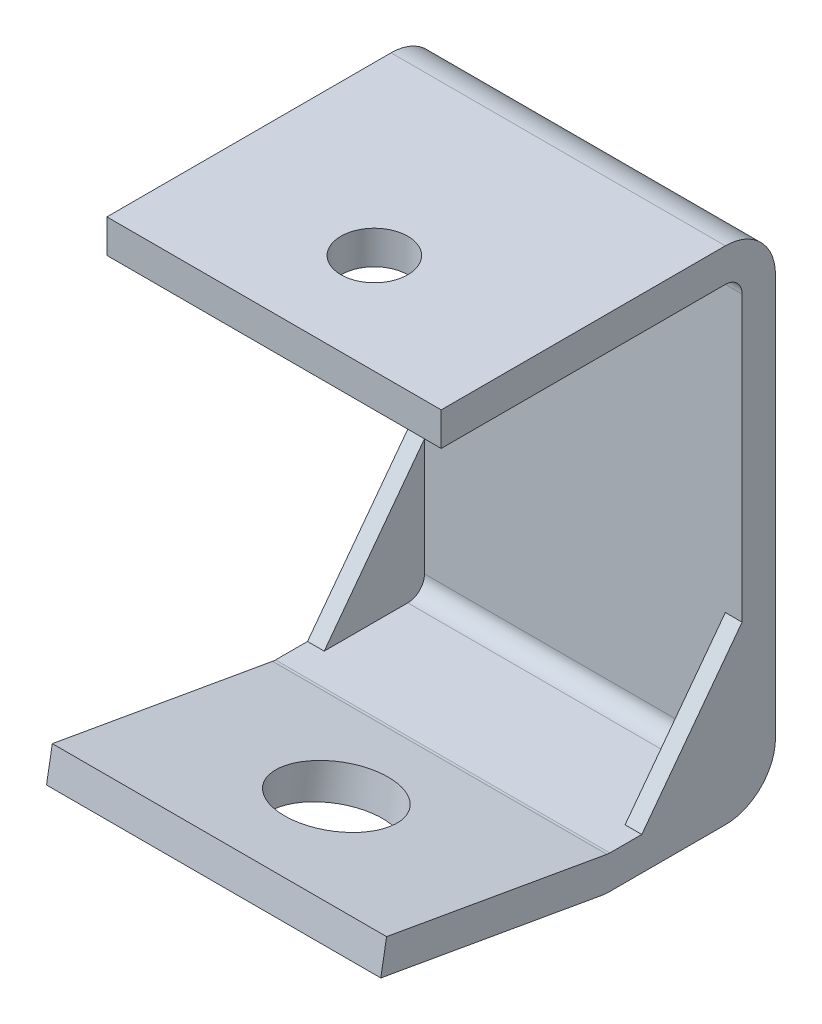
from build123d import *

# Parameters (mm, degrees)
BASE_EXTRUDE_THIN_DEPTH = 31.75
CUT_EXTRUDE1_REACH      = 123.615
SKETCH2_R               = 6.35
BOSS_EXTRUDE1_DEPTH     = 3.175
SKETCH4_R               = 10
CUT_EXTRUDE2_DEPTH      = 120.613937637


with BuildPart() as part:
    # Sketch1 → Base-Extrude-Thin (new, symmetric)
    with BuildSketch(Plane(origin=(0, 0, 0), x_dir=(0, 0, -1), z_dir=(1, 0, 0))):
        with BuildLine():
            Line((-67.523772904, 7.427557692), (-25.673556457, 0.048235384))
            ThreePointArc((-25.673556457, 0.048235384), (-25.398942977, 0.012081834), (-25.122223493, 0))
            Line((-25.122223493, 0), (-3.175, 0))
            ThreePointArc((-3.175, 0), (-0.92993597, 0.92993597), (0, 3.175))
            Line((0, 3.175), (0, 79.375))
            ThreePointArc((0, 79.375), (-0.92993597, 81.62006403), (-3.175, 82.55))
            Line((-3.175, 82.55), (-57.15, 82.55))
            Line((-57.15, 82.55), (-57.15, 88.9))
            Line((-57.15, 88.9), (-3.175, 88.9))
            ThreePointArc((-3.175, 88.9), (3.560192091, 86.110192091), (6.35, 79.375))
            Line((6.35, 79.375), (6.35, 3.175))
            ThreePointArc((6.35, 3.175), (3.560192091, -3.560192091), (-3.175, -6.35))
            Line((-3.175, -6.35), (-25.122223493, -6.35))
            ThreePointArc((-25.122223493, -6.35), (-25.952381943, -6.313754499), (-26.776222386, -6.205293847))
            Line((-26.776222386, -6.205293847), (-68.626438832, 1.174028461))
            Line((-68.626438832, 1.174028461), (-67.523772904, 7.427557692))
        make_face()
    extrude(amount=BASE_EXTRUDE_THIN_DEPTH, both=True)

    # Sketch2 → Cut-Extrude1 (cut, up to next)
    with BuildSketch(Plane(origin=(0, 88.9, 0), x_dir=(-1, 0, 0), z_dir=(0, 1, 0)), mode=Mode.PRIVATE) as cut_extrude1_sk1:
        with Locations(Location((0, 38.1, 0), (0, 0, 90))):
            Circle(SKETCH2_R)
    cut_extrude1_tool1 = extrude(cut_extrude1_sk1.sketch, amount=-CUT_EXTRUDE1_REACH, mode=Mode.PRIVATE) & part.part
    add(cut_extrude1_tool1.solids().sort_by_distance((0, 88.9, 38.1))[0], mode=Mode.SUBTRACT)

    # Sketch3 → Boss-Extrude1 (add)
    with BuildSketch(Plane(origin=(31.75, 0, 0), x_dir=(0, 0, -1), z_dir=(1, 0, 0))):
        with BuildLine():
            Line((-19.05, 0), (-3.175, 0))
            ThreePointArc((-3.175, 0), (-0.92993597, 0.92993597), (0, 3.175))
            Line((0, 3.175), (0, 25.4))
            Line((0, 25.4), (-19.05, 0))
        make_face()
    boss_extrude1 = extrude(amount=-BOSS_EXTRUDE1_DEPTH)

    # Mirror1: Boss-Extrude1 across plane
    add(boss_extrude1.mirror(Plane(origin=(0, 0, 0), x_dir=(0, 0, 1), z_dir=(1, 0, 0))))

    # Sketch4 → Cut-Extrude2 (cut, through all)
    with BuildSketch(Plane(origin=(0, -4.34365582, 0.765903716), x_dir=(-1, 0, 0), z_dir=(0, 0.984807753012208, -0.17364817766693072))):
        with Locations(Location((0, 45.239836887, 0), (0, 0, 90))):
            Circle(SKETCH4_R)
    extrude(amount=-CUT_EXTRUDE2_DEPTH, mode=Mode.SUBTRACT)


solid = part.part
